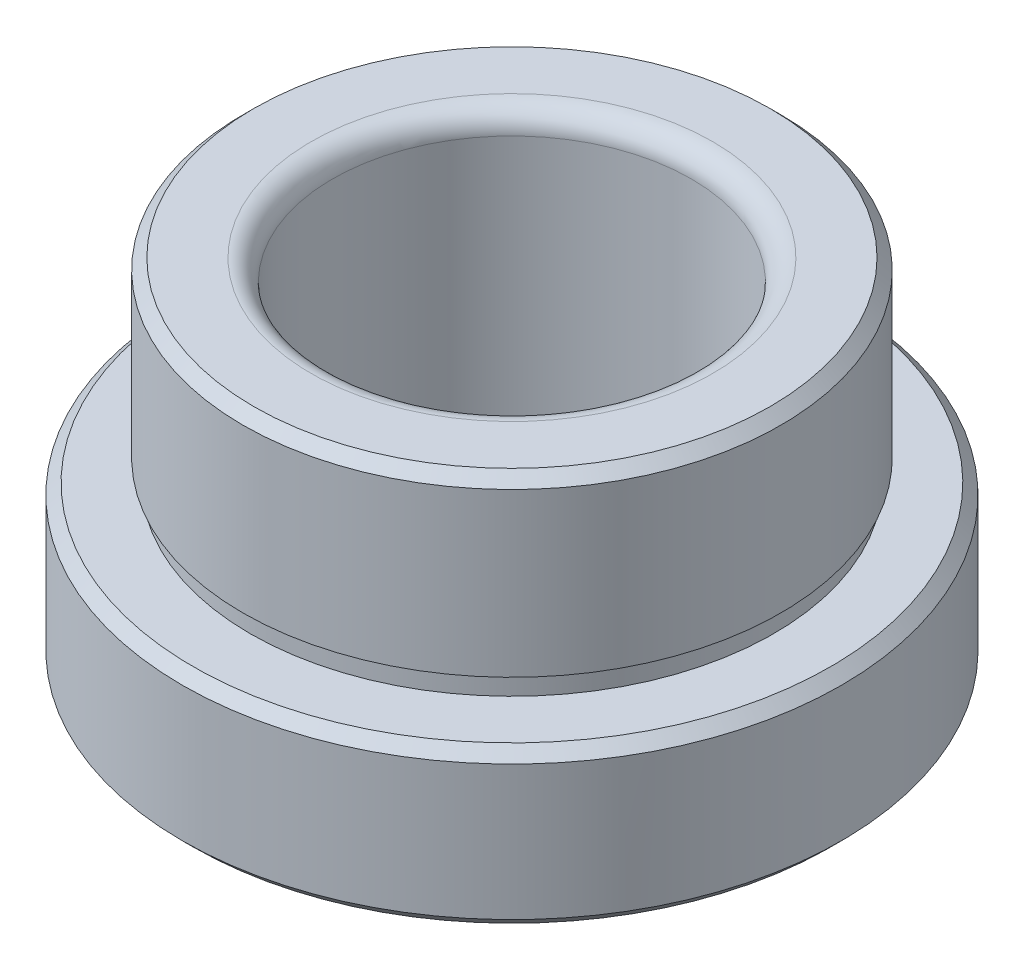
from build123d import *

# Parameters (mm, degrees)
FILLET1_R     = 0.762
CHAMFER1_SIZE = 0.762
CHAMFER2_SIZE = 0.381


with BuildPart() as part:
    # Sketch1 → Revolve1 (revolve)
    with BuildSketch(Plane.XY, mode=Mode.PRIVATE) as revolve1_sk:
        Polygon((6.35762, 12.446), (6.35762, 0), (11.684, 0), (11.684, 5.5372), (9.27989, 5.5372), (9.27989, 6.2992), (9.53389, 6.2992), (9.53389, 12.446), align=None)
    revolve(revolve1_sk.sketch.rotate(Axis((0, 10.518953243, 0), (0, -1, 0)), 90), axis=Axis((0, 10.518953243, 0), (0, -1, 0)))

    # Fillet1
    fillet1_edges = [part.edges().sort_by_distance(p)[0] for p in [
        (0, 12.446, -6.35762),
    ]]
    fillet(fillet1_edges, radius=FILLET1_R)

    # Chamfer1
    chamfer1_edges = [part.edges().sort_by_distance(p)[0] for p in [
        (0, 0, -6.35762),
    ]]
    chamfer(chamfer1_edges, length=CHAMFER1_SIZE)

    # Chamfer2
    chamfer2_edges = [part.edges().sort_by_distance(p)[0] for p in [
        (0, 0, -11.684),
        (0, 5.5372, -11.684),
        (0, 12.446, -9.53389),
    ]]
    chamfer(chamfer2_edges, length=CHAMFER2_SIZE)


solid = part.part
